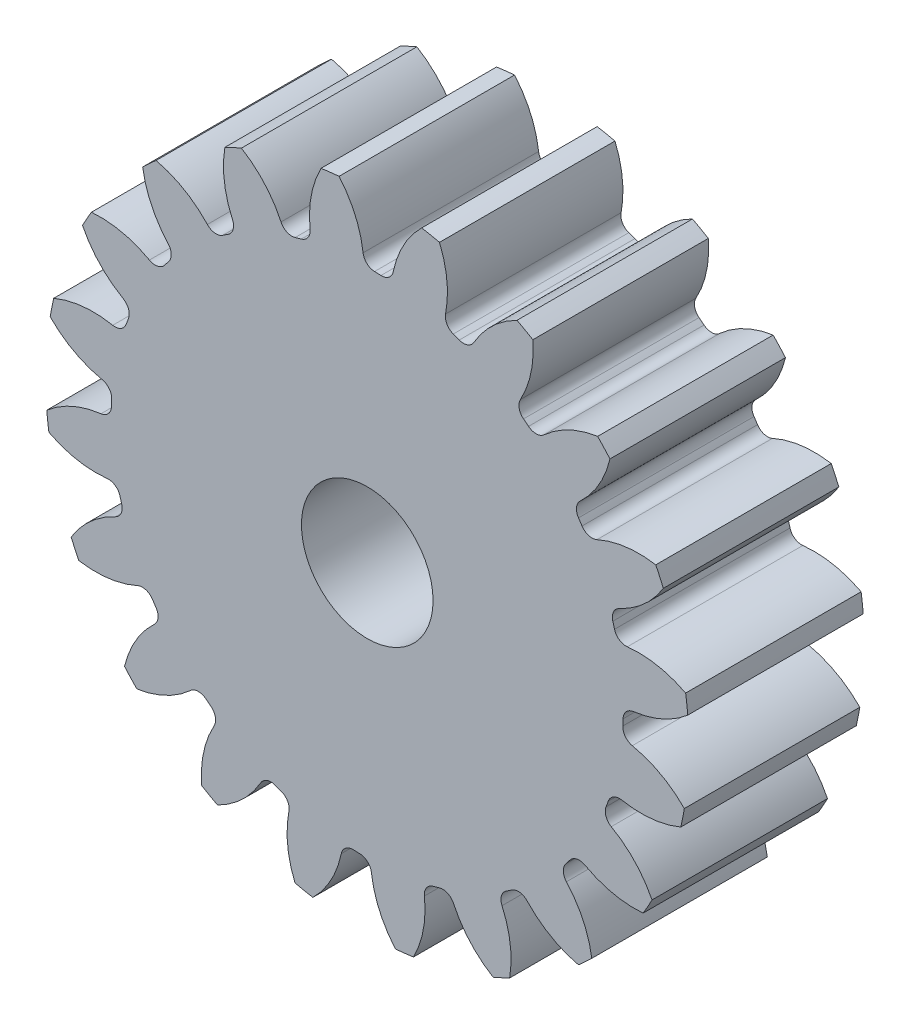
from build123d import *

# Parameters (mm, degrees)
SKETCH3_R         = 186.266666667
GEARBODY_DEPTH    = 101.6
TOOTHCUT_DEPTH    = 283.335088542
CIRPATTERN1_COUNT = 20
BOREDIA_R         = 38.1
BORE_DEPTH        = 12700


with BuildPart() as part:
    # Sketch3 → gearBody (new body)
    with BuildSketch(Plane.XY):
        Circle(SKETCH3_R)
    extrude(amount=GEARBODY_DEPTH)

    # Sketch2 → toothCut (cut, through all)
    with BuildSketch(Plane.XY):
        with BuildLine():
            ThreePointArc((147.95445984, -7.927100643), (148.041701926, -6.084044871), (148.105986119, -4.240045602))
            ThreePointArc((148.105986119, -4.240045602), (149.900443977, 0.204177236), (154.15877751, 2.403675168))
            ThreePointArc((154.15877751, 2.403675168), (171.325955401, 7.219884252), (186.266666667, 16.950403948))
            ThreePointArc((186.266666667, 16.950403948), (186.878578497, -7.680117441), (184.247670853, -32.177369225))
            ThreePointArc((184.247670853, -32.177369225), (170.155781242, -21.253701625), (153.441688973, -15.045079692))
            ThreePointArc((153.441688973, -15.045079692), (149.378195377, -12.503581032), (147.95445984, -7.927100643))
        make_face()
    toothcut = extrude(amount=TOOTHCUT_DEPTH, mode=Mode.SUBTRACT)

    # CirPattern1: toothCut ×20 about axis
    cirpattern1_axis = Axis((0, 0, 0), (0, 0, 1))
    for i in range(1, CIRPATTERN1_COUNT):
        add(toothcut.rotate(cirpattern1_axis, i * 360 / CIRPATTERN1_COUNT), mode=Mode.SUBTRACT)

    # boreDia → bore (cut, symmetric)
    with BuildSketch(Plane.XY):
        Circle(BOREDIA_R)
    extrude(amount=BORE_DEPTH, both=True, mode=Mode.SUBTRACT)


solid = part.part
